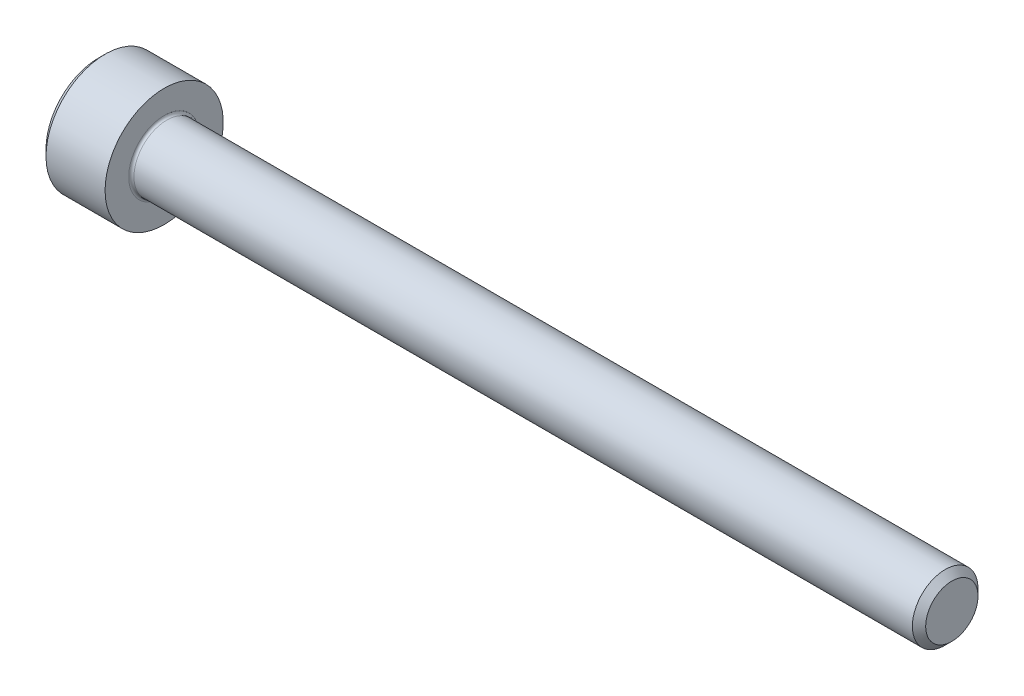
from build123d import *

# Parameters (mm, degrees)
FILLET1_R   = 0.1
HEX_2_DEPTH = 1.1


with BuildPart() as part:
    # BodySke → Base-Revolve (revolve)
    with BuildSketch(Plane.XY, mode=Mode.PRIVATE) as base_revolve_sk:
        Polygon((0, 0), (0, 2), (0.25, 2.25), (2.5, 2.25), (2.5, 1.25), (32.2465, 1.25), (32.5, 0.9965), (32.5, 0), align=None)
    revolve(base_revolve_sk.sketch.rotate(Axis((-31.75, 0, 0), (1, 0, 0)), 90), axis=Axis((-31.75, 0, 0), (1, 0, 0)))

    # Fillet1
    fillet1_edges = [part.edges().sort_by_distance(p)[0] for p in [
        (2.5, 0, -1.25),
    ]]
    fillet(fillet1_edges, radius=FILLET1_R)

    # Sketch2 → Hex-PreBroach (revolve, cut)
    with BuildSketch(Plane.XY, mode=Mode.PRIVATE) as hex_prebroach_sk:
        Polygon((0, 1.0225), (1.1, 1.0225), (1.69034065, 0), (0, 0), align=None)
    revolve(hex_prebroach_sk.sketch.rotate(Axis((0, 0, 0), (1, 0, 0)), 90), axis=Axis((0, 0, 0), (1, 0, 0)), mode=Mode.SUBTRACT)

    # Sketch3 → Hex 2 (cut)
    with BuildSketch(Plane(origin=(0, 0, 0), x_dir=(0, 0.500000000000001, 0.866025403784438), z_dir=(-1, 0, 0))):
        Polygon((0.59034065, 1.0225), (-0.59034065, 1.0225), (-1.1806813, 0), (-0.59034065, -1.0225), (0.59034065, -1.0225), (1.1806813, 0), align=None)
    extrude(amount=-HEX_2_DEPTH, mode=Mode.SUBTRACT)


solid = part.part
